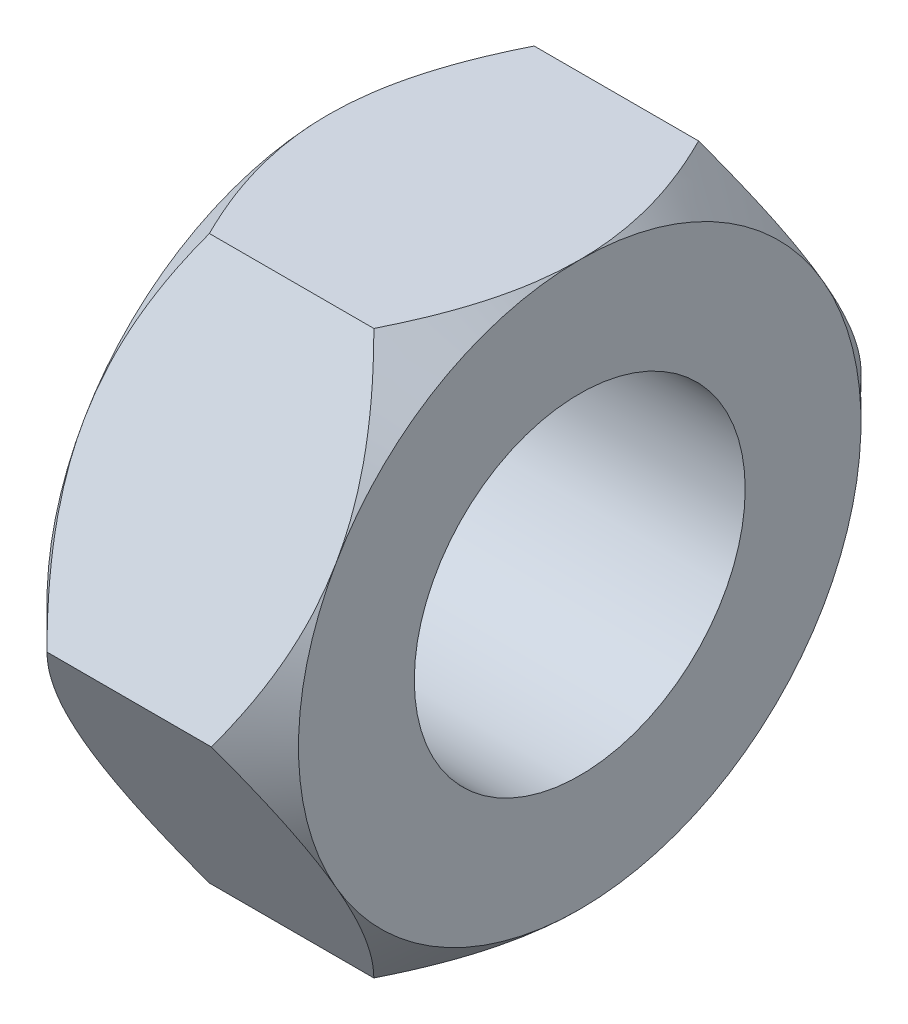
ISO-10303-21;
HEADER;
FILE_DESCRIPTION(('STEP AP214'),'2;1');
FILE_NAME('part.step','',(''),(''),'','','');
FILE_SCHEMA(('AUTOMOTIVE_DESIGN { 1 0 10303 214 1 1 1 1 }'));
ENDSEC;
DATA;
#1=APPLICATION_CONTEXT('core data for automotive mechanical design processes');
#2=APPLICATION_PROTOCOL_DEFINITION('international standard','automotive_design',2000,#1);
#3=PRODUCT_CONTEXT('',#1,'mechanical');
#4=PRODUCT('Part','Part','',(#3));
#5=PRODUCT_RELATED_PRODUCT_CATEGORY('part','',(#4));
#6=PRODUCT_DEFINITION_FORMATION('','',#4);
#7=PRODUCT_DEFINITION_CONTEXT('part definition',#1,'design');
#8=PRODUCT_DEFINITION('design','',#6,#7);
#9=PRODUCT_DEFINITION_SHAPE('','',#8);
#10=(LENGTH_UNIT() NAMED_UNIT(*) SI_UNIT(.MILLI.,.METRE.));
#11=(NAMED_UNIT(*) PLANE_ANGLE_UNIT() SI_UNIT($,.RADIAN.));
#12=(NAMED_UNIT(*) SI_UNIT($,.STERADIAN.) SOLID_ANGLE_UNIT());
#13=UNCERTAINTY_MEASURE_WITH_UNIT(LENGTH_MEASURE(1.E-05),#10,'distance_accuracy_value','');
#14=(GEOMETRIC_REPRESENTATION_CONTEXT(3) GLOBAL_UNCERTAINTY_ASSIGNED_CONTEXT((#13)) GLOBAL_UNIT_ASSIGNED_CONTEXT((#10,
#11,#12)) REPRESENTATION_CONTEXT('',''));
#15=CARTESIAN_POINT('',(0.,0.,0.));
#16=DIRECTION('',(0.,0.,1.));
#17=DIRECTION('',(1.,0.,0.));
#18=AXIS2_PLACEMENT_3D('',#15,#16,#17);
#19=CARTESIAN_POINT('',(0.,0.,0.));
#20=DIRECTION('',(1.,0.,0.));
#21=DIRECTION('',(0.,1.,0.));
#22=AXIS2_PLACEMENT_3D('',#19,#20,#21);
#23=PLANE('',#22);
#24=CARTESIAN_POINT('',(0.,0.,0.));
#25=DIRECTION('',(-1.,0.,0.));
#26=DIRECTION('',(0.,0.,1.));
#27=AXIS2_PLACEMENT_3D('',#24,#25,#26);
#28=CIRCLE('',#27,8.5);
#29=CARTESIAN_POINT('',(0.,4.24999999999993,-7.36121593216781));
#30=VERTEX_POINT('',#29);
#31=CARTESIAN_POINT('',(0.,-4.25,-7.36121593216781));
#32=VERTEX_POINT('',#31);
#33=EDGE_CURVE('E11',#30,#32,#28,.T.);
#34=ORIENTED_EDGE('',*,*,#33,.T.);
#35=CARTESIAN_POINT('',(0.,0.,0.));
#36=DIRECTION('',(-1.,0.,0.));
#37=DIRECTION('',(0.,0.,1.));
#38=AXIS2_PLACEMENT_3D('',#35,#36,#37);
#39=CIRCLE('',#38,8.5);
#40=CARTESIAN_POINT('',(0.,-8.5,0.));
#41=VERTEX_POINT('',#40);
#42=EDGE_CURVE('E25',#32,#41,#39,.T.);
#43=ORIENTED_EDGE('',*,*,#42,.T.);
#44=CARTESIAN_POINT('',(0.,0.,0.));
#45=DIRECTION('',(-1.,0.,0.));
#46=DIRECTION('',(0.,1.,0.));
#47=AXIS2_PLACEMENT_3D('',#44,#45,#46);
#48=CIRCLE('',#47,8.5);
#49=CARTESIAN_POINT('',(0.,-4.25,7.36121593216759));
#50=VERTEX_POINT('',#49);
#51=EDGE_CURVE('E360',#41,#50,#48,.T.);
#52=ORIENTED_EDGE('',*,*,#51,.T.);
#53=CARTESIAN_POINT('',(0.,0.,0.));
#54=DIRECTION('',(-1.,0.,0.));
#55=DIRECTION('',(0.,1.,0.));
#56=AXIS2_PLACEMENT_3D('',#53,#54,#55);
#57=CIRCLE('',#56,8.5);
#58=CARTESIAN_POINT('',(0.,4.24999999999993,7.36121593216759));
#59=VERTEX_POINT('',#58);
#60=EDGE_CURVE('E134',#50,#59,#57,.T.);
#61=ORIENTED_EDGE('',*,*,#60,.T.);
#62=CARTESIAN_POINT('',(0.,0.,0.));
#63=DIRECTION('',(-1.,0.,0.));
#64=DIRECTION('',(0.,1.,0.));
#65=AXIS2_PLACEMENT_3D('',#62,#63,#64);
#66=CIRCLE('',#65,8.5);
#67=CARTESIAN_POINT('',(0.,8.5,0.));
#68=VERTEX_POINT('',#67);
#69=EDGE_CURVE('E393',#59,#68,#66,.T.);
#70=ORIENTED_EDGE('',*,*,#69,.T.);
#71=CARTESIAN_POINT('',(0.,0.,0.));
#72=DIRECTION('',(-1.,0.,0.));
#73=DIRECTION('',(0.,0.,1.));
#74=AXIS2_PLACEMENT_3D('',#71,#72,#73);
#75=CIRCLE('',#74,8.5);
#76=EDGE_CURVE('E32',#68,#30,#75,.T.);
#77=ORIENTED_EDGE('',*,*,#76,.T.);
#78=EDGE_LOOP('',(#34,#43,#52,#61,#70,#77));
#79=FACE_BOUND('',#78,.T.);
#80=CARTESIAN_POINT('',(0.,0.,0.));
#81=DIRECTION('',(1.,0.,0.));
#82=DIRECTION('',(0.,1.,0.));
#83=AXIS2_PLACEMENT_3D('',#80,#81,#82);
#84=CIRCLE('',#83,5.);
#85=CARTESIAN_POINT('',(0.,4.99999999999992,0.));
#86=VERTEX_POINT('',#85);
#87=EDGE_CURVE('E20',#86,#86,#84,.F.);
#88=ORIENTED_EDGE('',*,*,#87,.F.);
#89=EDGE_LOOP('',(#88));
#90=FACE_BOUND('',#89,.T.);
#91=ADVANCED_FACE('F17',(#79,#90),#23,.F.);
#92=CARTESIAN_POINT('',(6.2771556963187,0.,0.));
#93=DIRECTION('',(-1.,0.,0.));
#94=DIRECTION('',(0.,0.,1.));
#95=AXIS2_PLACEMENT_3D('',#92,#93,#94);
#96=CONICAL_SURFACE('',#95,9.82284430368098,0.78539816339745);
#97=CARTESIAN_POINT('',(7.6,-4.25,-7.36121593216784));
#98=CARTESIAN_POINT('',(7.60001515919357,-4.13694792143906,-7.42648658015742));
#99=CARTESIAN_POINT('',(7.59699316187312,-4.02390032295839,-7.49175464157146));
#100=CARTESIAN_POINT('',(7.58498745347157,-3.79805996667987,-7.62214363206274));
#101=CARTESIAN_POINT('',(7.57600468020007,-3.68526717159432,-7.68726458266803));
#102=CARTESIAN_POINT('',(7.55221084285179,-3.4603440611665,-7.81712400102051));
#103=CARTESIAN_POINT('',(7.53741003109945,-3.34821293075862,-7.88186293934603));
#104=CARTESIAN_POINT('',(7.50219326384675,-3.1246187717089,-8.01095508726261));
#105=CARTESIAN_POINT('',(7.48177715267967,-3.01315576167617,-8.0753082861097));
#106=CARTESIAN_POINT('',(7.41318934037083,-2.68340027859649,-8.2656927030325));
#107=CARTESIAN_POINT('',(7.35729647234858,-2.46628706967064,-8.39104307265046));
#108=CARTESIAN_POINT('',(7.22718259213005,-2.03622203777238,-8.63934123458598));
#109=CARTESIAN_POINT('',(7.1529558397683,-1.82327154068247,-8.76228826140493));
#110=CARTESIAN_POINT('',(7.01731534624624,-1.47499253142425,-8.96336724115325));
#111=CARTESIAN_POINT('',(6.96037400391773,-1.33833581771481,-9.04226603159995));
#112=CARTESIAN_POINT('',(6.84054553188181,-1.06702543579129,-9.19890715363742));
#113=CARTESIAN_POINT('',(6.77765965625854,-0.932371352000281,-9.27664972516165));
#114=CARTESIAN_POINT('',(6.64593076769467,-0.663632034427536,-9.43180644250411));
#115=CARTESIAN_POINT('',(6.57703288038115,-0.529567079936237,-9.50920888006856));
#116=CARTESIAN_POINT('',(6.43446542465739,-0.263361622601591,-9.66290267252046));
#117=CARTESIAN_POINT('',(6.36079617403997,-0.131220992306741,-9.73919410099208));
#118=CARTESIAN_POINT('',(6.2850454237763,0.,-9.81495457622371));
#119=B_SPLINE_CURVE_WITH_KNOTS('',3,(#97,#98,#99,#100,#101,#102,#103,#104,#105,#106,#107,#108,
#109,#110,#111,#112,#113,#114,#115,#116,#117,#118),.UNSPECIFIED.,.F.,.F.,(4,2,2,2,2,2,2,2,2,2,
4),(0.,0.391580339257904,0.783099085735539,1.17393098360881,1.56477371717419,2.3344775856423,
3.10442274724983,3.60757640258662,4.11062414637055,4.61887351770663,5.12708907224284),.UNSPECIFIED.);
#120=CARTESIAN_POINT('',(7.6,-4.25,-7.36121593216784));
#121=VERTEX_POINT('',#120);
#122=CARTESIAN_POINT('',(6.2850454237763,0.,-9.81495457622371));
#123=VERTEX_POINT('',#122);
#124=EDGE_CURVE('E245',#121,#123,#119,.T.);
#125=ORIENTED_EDGE('',*,*,#124,.T.);
#126=CARTESIAN_POINT('',(6.2850454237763,0.,-9.81495457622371));
#127=CARTESIAN_POINT('',(6.3699516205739,0.147093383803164,-9.73003017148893));
#128=CARTESIAN_POINT('',(6.45223328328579,0.295306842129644,-9.6444590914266));
#129=CARTESIAN_POINT('',(6.61075078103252,0.5942375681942,-9.47187135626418));
#130=CARTESIAN_POINT('',(6.68698311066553,0.744956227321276,-9.38485389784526));
#131=CARTESIAN_POINT('',(6.90612802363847,1.20280955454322,-9.12051215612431));
#132=CARTESIAN_POINT('',(7.03846244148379,1.51390387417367,-8.9409017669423));
#133=CARTESIAN_POINT('',(7.2077707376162,1.98338150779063,-8.66984872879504));
#134=CARTESIAN_POINT('',(7.25878555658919,2.13801850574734,-8.58056901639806));
#135=CARTESIAN_POINT('',(7.35113981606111,2.44943193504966,-8.40077438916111));
#136=CARTESIAN_POINT('',(7.3924815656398,2.60620784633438,-8.31025977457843));
#137=CARTESIAN_POINT('',(7.46444988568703,2.92116365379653,-8.12841995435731));
#138=CARTESIAN_POINT('',(7.49510489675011,3.07933865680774,-8.0370975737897));
#139=CARTESIAN_POINT('',(7.54505025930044,3.39699973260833,-7.8536958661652));
#140=CARTESIAN_POINT('',(7.56434424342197,3.5564853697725,-7.76161679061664));
#141=CARTESIAN_POINT('',(7.58509137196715,3.80494538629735,-7.61816833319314));
#142=CARTESIAN_POINT('',(7.59066337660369,3.89367407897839,-7.56694079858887));
#143=CARTESIAN_POINT('',(7.5981272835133,4.07159923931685,-7.46421565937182));
#144=CARTESIAN_POINT('',(7.60000452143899,4.16079616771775,-7.41271778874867));
#145=CARTESIAN_POINT('',(7.6,4.24999999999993,-7.36121593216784));
#146=B_SPLINE_CURVE_WITH_KNOTS('',3,(#126,#127,#128,#129,#130,#131,#132,#133,#134,#135,#136,
#137,#138,#139,#140,#141,#142,#143,#144,#145),.UNSPECIFIED.,.F.,.F.,(4,2,2,2,2,2,2,2,2,4),(0.,
0.569593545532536,1.13951477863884,2.28610326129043,2.84300305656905,3.39976977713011,
3.95504325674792,4.51013909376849,4.81789866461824,5.12687727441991),.UNSPECIFIED.);
#147=CARTESIAN_POINT('',(7.6,4.24999999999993,-7.36121593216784));
#148=VERTEX_POINT('',#147);
#149=EDGE_CURVE('E256',#123,#148,#146,.T.);
#150=ORIENTED_EDGE('',*,*,#149,.T.);
#151=CARTESIAN_POINT('',(7.6,0.,-1.34587772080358E-13));
#152=DIRECTION('',(-1.,0.,0.));
#153=DIRECTION('',(0.,0.,1.));
#154=AXIS2_PLACEMENT_3D('',#151,#152,#153);
#155=CIRCLE('',#154,8.5);
#156=EDGE_CURVE('E382',#148,#121,#155,.T.);
#157=ORIENTED_EDGE('',*,*,#156,.T.);
#158=EDGE_LOOP('',(#125,#150,#157));
#159=FACE_BOUND('',#158,.T.);
#160=ADVANCED_FACE('F230',(#159),#96,.T.);
#161=CARTESIAN_POINT('',(6.2771556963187,0.,0.));
#162=DIRECTION('',(-1.,0.,0.));
#163=DIRECTION('',(0.,0.,1.));
#164=AXIS2_PLACEMENT_3D('',#161,#162,#163);
#165=CONICAL_SURFACE('',#164,9.82284430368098,0.78539816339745);
#166=CARTESIAN_POINT('',(7.6,-8.5,-1.34587772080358E-13));
#167=CARTESIAN_POINT('',(7.6000151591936,-8.49999999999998,-0.130541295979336));
#168=CARTESIAN_POINT('',(7.59699316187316,-8.49999999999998,-0.261077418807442));
#169=CARTESIAN_POINT('',(7.58498745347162,-8.49999999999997,-0.521855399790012));
#170=CARTESIAN_POINT('',(7.57600468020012,-8.49999999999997,-0.652097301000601));
#171=CARTESIAN_POINT('',(7.55221084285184,-8.49999999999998,-0.911816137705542));
#172=CARTESIAN_POINT('',(7.53741003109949,-8.49999999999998,-1.0412940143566));
#173=CARTESIAN_POINT('',(7.5021932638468,-8.49999999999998,-1.29947831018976));
#174=CARTESIAN_POINT('',(7.48177715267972,-8.49999999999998,-1.42818470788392));
#175=CARTESIAN_POINT('',(7.41318934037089,-8.49999999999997,-1.80895354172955));
#176=CARTESIAN_POINT('',(7.35729647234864,-8.49999999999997,-2.05965428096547));
#177=CARTESIAN_POINT('',(7.22718259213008,-8.49999999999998,-2.55625060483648));
#178=CARTESIAN_POINT('',(7.15295583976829,-8.50000000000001,-2.80214465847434));
#179=CARTESIAN_POINT('',(7.01731534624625,-8.5,-3.204302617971));
#180=CARTESIAN_POINT('',(6.96037400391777,-8.49999999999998,-3.36210019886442));
#181=CARTESIAN_POINT('',(6.84054553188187,-8.49999999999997,-3.67538244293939));
#182=CARTESIAN_POINT('',(6.77765965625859,-8.49999999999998,-3.83086758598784));
#183=CARTESIAN_POINT('',(6.64593076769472,-8.49999999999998,-4.14118102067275));
#184=CARTESIAN_POINT('',(6.57703288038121,-8.49999999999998,-4.29598589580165));
#185=CARTESIAN_POINT('',(6.43446542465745,-8.49999999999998,-4.60337348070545));
#186=CARTESIAN_POINT('',(6.36079617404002,-8.49999999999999,-4.75595633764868));
#187=CARTESIAN_POINT('',(6.2850454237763,-8.5,-4.90747728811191));
#188=B_SPLINE_CURVE_WITH_KNOTS('',3,(#166,#167,#168,#169,#170,#171,#172,#173,#174,#175,#176,
#177,#178,#179,#180,#181,#182,#183,#184,#185,#186,#187),.UNSPECIFIED.,.F.,.F.,(4,2,2,2,2,2,2,2,
2,2,4),(0.,0.391580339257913,0.783099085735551,1.17393098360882,1.5647737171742,
2.33447758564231,3.10442274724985,3.60757640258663,4.11062414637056,4.61887351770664,
5.12708907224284),.UNSPECIFIED.);
#189=CARTESIAN_POINT('',(7.6,-8.5,-1.34587772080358E-13));
#190=VERTEX_POINT('',#189);
#191=CARTESIAN_POINT('',(6.2850454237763,-8.5,-4.90747728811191));
#192=VERTEX_POINT('',#191);
#193=EDGE_CURVE('E203',#190,#192,#188,.T.);
#194=ORIENTED_EDGE('',*,*,#193,.T.);
#195=CARTESIAN_POINT('',(6.2850454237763,-8.5,-4.90747728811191));
#196=CARTESIAN_POINT('',(6.36995162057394,-8.35290661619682,-4.99240169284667));
#197=CARTESIAN_POINT('',(6.45223328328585,-8.20469315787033,-5.07797277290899));
#198=CARTESIAN_POINT('',(6.6107507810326,-7.90576243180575,-5.25056050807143));
#199=CARTESIAN_POINT('',(6.68698311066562,-7.75504377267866,-5.33757796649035));
#200=CARTESIAN_POINT('',(6.90612802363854,-7.29719044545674,-5.60191970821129));
#201=CARTESIAN_POINT('',(7.03846244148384,-6.98609612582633,-5.78153009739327));
#202=CARTESIAN_POINT('',(7.20777073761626,-6.51661849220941,-6.05258313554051));
#203=CARTESIAN_POINT('',(7.25878555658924,-6.3619814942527,-6.14186284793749));
#204=CARTESIAN_POINT('',(7.35113981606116,-6.05056806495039,-6.32165747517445));
#205=CARTESIAN_POINT('',(7.39248156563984,-5.89379215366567,-6.41217208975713));
#206=CARTESIAN_POINT('',(7.4644498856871,-5.57883634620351,-6.59401190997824));
#207=CARTESIAN_POINT('',(7.49510489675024,-5.42066134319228,-6.68533429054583));
#208=CARTESIAN_POINT('',(7.54505025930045,-5.10300026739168,-6.8687359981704));
#209=CARTESIAN_POINT('',(7.56434424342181,-4.94351463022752,-6.96081507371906));
#210=CARTESIAN_POINT('',(7.58509137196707,-4.69505461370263,-7.10426353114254));
#211=CARTESIAN_POINT('',(7.59066337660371,-4.60632592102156,-7.15549106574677));
#212=CARTESIAN_POINT('',(7.59812728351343,-4.42840076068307,-7.25821620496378));
#213=CARTESIAN_POINT('',(7.60000452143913,-4.33920383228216,-7.30971407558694));
#214=CARTESIAN_POINT('',(7.6,-4.25,-7.36121593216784));
#215=B_SPLINE_CURVE_WITH_KNOTS('',3,(#195,#196,#197,#198,#199,#200,#201,#202,#203,#204,#205,
#206,#207,#208,#209,#210,#211,#212,#213,#214),.UNSPECIFIED.,.F.,.F.,(4,2,2,2,2,2,2,2,2,4),(0.,
0.569593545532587,1.13951477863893,2.28610326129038,2.84300305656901,3.39976977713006,
3.9550432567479,4.51013909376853,4.81789866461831,5.12687727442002),.UNSPECIFIED.);
#216=EDGE_CURVE('E238',#192,#121,#215,.T.);
#217=ORIENTED_EDGE('',*,*,#216,.T.);
#218=CARTESIAN_POINT('',(7.6,0.,-1.34587772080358E-13));
#219=DIRECTION('',(-1.,0.,0.));
#220=DIRECTION('',(0.,0.,1.));
#221=AXIS2_PLACEMENT_3D('',#218,#219,#220);
#222=CIRCLE('',#221,8.5);
#223=EDGE_CURVE('E401',#121,#190,#222,.T.);
#224=ORIENTED_EDGE('',*,*,#223,.T.);
#225=EDGE_LOOP('',(#194,#217,#224));
#226=FACE_BOUND('',#225,.T.);
#227=ADVANCED_FACE('F225',(#226),#165,.T.);
#228=CARTESIAN_POINT('',(6.2771556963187,0.,0.));
#229=DIRECTION('',(-1.,0.,0.));
#230=DIRECTION('',(0.,1.,0.));
#231=AXIS2_PLACEMENT_3D('',#228,#229,#230);
#232=CONICAL_SURFACE('',#231,9.82284430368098,0.78539816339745);
#233=CARTESIAN_POINT('',(7.6,-4.25,7.36121593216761));
#234=CARTESIAN_POINT('',(7.60001515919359,-4.36305207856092,7.29594528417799));
#235=CARTESIAN_POINT('',(7.59699316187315,-4.47609967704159,7.23067722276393));
#236=CARTESIAN_POINT('',(7.58498745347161,-4.70194003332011,7.10028823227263));
#237=CARTESIAN_POINT('',(7.5760046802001,-4.81473282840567,7.03516728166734));
#238=CARTESIAN_POINT('',(7.55221084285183,-5.0396559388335,6.90530786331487));
#239=CARTESIAN_POINT('',(7.53741003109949,-5.15178706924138,6.84056892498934));
#240=CARTESIAN_POINT('',(7.50219326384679,-5.37538122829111,6.71147677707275));
#241=CARTESIAN_POINT('',(7.48177715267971,-5.48684423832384,6.64712357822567));
#242=CARTESIAN_POINT('',(7.41318934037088,-5.81659972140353,6.45673916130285));
#243=CARTESIAN_POINT('',(7.35729647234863,-6.03371293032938,6.33138879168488));
#244=CARTESIAN_POINT('',(7.22718259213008,-6.46377796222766,6.08309062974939));
#245=CARTESIAN_POINT('',(7.15295583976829,-6.6767284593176,5.96014360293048));
#246=CARTESIAN_POINT('',(7.01731534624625,-7.02500746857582,5.75906462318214));
#247=CARTESIAN_POINT('',(6.96037400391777,-7.16166418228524,5.68016583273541));
#248=CARTESIAN_POINT('',(6.84054553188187,-7.43297456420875,5.52352471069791));
#249=CARTESIAN_POINT('',(6.77765965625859,-7.56762864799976,5.4457821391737));
#250=CARTESIAN_POINT('',(6.64593076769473,-7.8363679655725,5.29062542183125));
#251=CARTESIAN_POINT('',(6.57703288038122,-7.97043292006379,5.2132229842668));
#252=CARTESIAN_POINT('',(6.43446542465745,-8.23663837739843,5.0595291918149));
#253=CARTESIAN_POINT('',(6.36079617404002,-8.36877900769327,4.98323776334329));
#254=CARTESIAN_POINT('',(6.2850454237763,-8.5,4.9074772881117));
#255=B_SPLINE_CURVE_WITH_KNOTS('',3,(#233,#234,#235,#236,#237,#238,#239,#240,#241,#242,#243,
#244,#245,#246,#247,#248,#249,#250,#251,#252,#253,#254),.UNSPECIFIED.,.F.,.F.,(4,2,2,2,2,2,2,2,
2,2,4),(0.,0.391580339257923,0.783099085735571,1.17393098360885,1.56477371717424,
2.33447758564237,3.10442274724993,3.6075764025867,4.11062414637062,4.61887351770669,
5.12708907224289),.UNSPECIFIED.);
#256=CARTESIAN_POINT('',(7.6,-4.25,7.36121593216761));
#257=VERTEX_POINT('',#256);
#258=CARTESIAN_POINT('',(6.2850454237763,-8.5,4.9074772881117));
#259=VERTEX_POINT('',#258);
#260=EDGE_CURVE('E366',#257,#259,#255,.T.);
#261=ORIENTED_EDGE('',*,*,#260,.T.);
#262=CARTESIAN_POINT('',(6.2850454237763,-8.5,4.9074772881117));
#263=CARTESIAN_POINT('',(6.36995162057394,-8.49999999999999,4.73762847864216));
#264=CARTESIAN_POINT('',(6.45223328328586,-8.49999999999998,4.56648631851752));
#265=CARTESIAN_POINT('',(6.61075078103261,-8.49999999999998,4.22131084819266));
#266=CARTESIAN_POINT('',(6.68698311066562,-8.49999999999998,4.04727593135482));
#267=CARTESIAN_POINT('',(6.90612802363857,-8.49999999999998,3.51859244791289));
#268=CARTESIAN_POINT('',(7.03846244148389,-8.49999999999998,3.15937166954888));
#269=CARTESIAN_POINT('',(7.20777073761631,-8.49999999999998,2.61726559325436));
#270=CARTESIAN_POINT('',(7.2587855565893,-8.49999999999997,2.4387061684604));
#271=CARTESIAN_POINT('',(7.35113981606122,-8.49999999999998,2.07911691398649));
#272=CARTESIAN_POINT('',(7.39248156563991,-8.49999999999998,1.89808768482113));
#273=CARTESIAN_POINT('',(7.46444988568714,-8.49999999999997,1.53440804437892));
#274=CARTESIAN_POINT('',(7.49510489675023,-8.49999999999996,1.35176328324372));
#275=CARTESIAN_POINT('',(7.54505025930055,-8.49999999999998,0.984959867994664));
#276=CARTESIAN_POINT('',(7.56434424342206,-8.50000000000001,0.800801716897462));
#277=CARTESIAN_POINT('',(7.58509137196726,-8.49999999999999,0.513904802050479));
#278=CARTESIAN_POINT('',(7.59066337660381,-8.49999999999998,0.41144973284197));
#279=CARTESIAN_POINT('',(7.59812728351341,-8.49999999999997,0.205999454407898));
#280=CARTESIAN_POINT('',(7.60000452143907,-8.49999999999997,0.103003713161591));
#281=CARTESIAN_POINT('',(7.6,-8.5,-1.34587772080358E-13));
#282=B_SPLINE_CURVE_WITH_KNOTS('',3,(#262,#263,#264,#265,#266,#267,#268,#269,#270,#271,#272,
#273,#274,#275,#276,#277,#278,#279,#280,#281),.UNSPECIFIED.,.F.,.F.,(4,2,2,2,2,2,2,2,2,4),(0.,
0.569593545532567,1.1395147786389,2.2861032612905,2.84300305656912,3.39976977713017,
3.95504325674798,4.51013909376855,4.81789866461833,5.12687727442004),.UNSPECIFIED.);
#283=EDGE_CURVE('E211',#259,#190,#282,.T.);
#284=ORIENTED_EDGE('',*,*,#283,.T.);
#285=CARTESIAN_POINT('',(7.6,0.,-1.34587772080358E-13));
#286=DIRECTION('',(-1.,0.,0.));
#287=DIRECTION('',(0.,1.,0.));
#288=AXIS2_PLACEMENT_3D('',#285,#286,#287);
#289=CIRCLE('',#288,8.5);
#290=EDGE_CURVE('E402',#190,#257,#289,.T.);
#291=ORIENTED_EDGE('',*,*,#290,.T.);
#292=EDGE_LOOP('',(#261,#284,#291));
#293=FACE_BOUND('',#292,.T.);
#294=ADVANCED_FACE('F229',(#293),#232,.T.);
#295=CARTESIAN_POINT('',(6.2771556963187,0.,0.));
#296=DIRECTION('',(-1.,0.,0.));
#297=DIRECTION('',(0.,1.,0.));
#298=AXIS2_PLACEMENT_3D('',#295,#296,#297);
#299=CONICAL_SURFACE('',#298,9.82284430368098,0.78539816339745);
#300=CARTESIAN_POINT('',(7.6,0.,-1.34587772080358E-13));
#301=DIRECTION('',(-1.,0.,0.));
#302=DIRECTION('',(0.,1.,0.));
#303=AXIS2_PLACEMENT_3D('',#300,#301,#302);
#304=CIRCLE('',#303,8.5);
#305=CARTESIAN_POINT('',(7.6,4.24999999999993,7.36121593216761));
#306=VERTEX_POINT('',#305);
#307=EDGE_CURVE('E406',#257,#306,#304,.T.);
#308=ORIENTED_EDGE('',*,*,#307,.T.);
#309=CARTESIAN_POINT('',(7.6,4.24999999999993,7.36121593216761));
#310=CARTESIAN_POINT('',(7.60001515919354,4.13694792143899,7.42648658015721));
#311=CARTESIAN_POINT('',(7.59699316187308,4.02390032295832,7.49175464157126));
#312=CARTESIAN_POINT('',(7.58498745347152,3.79805996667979,7.62214363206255));
#313=CARTESIAN_POINT('',(7.57600468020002,3.68526717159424,7.68726458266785));
#314=CARTESIAN_POINT('',(7.55221084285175,3.46034406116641,7.81712400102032));
#315=CARTESIAN_POINT('',(7.53741003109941,3.34821293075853,7.88186293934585));
#316=CARTESIAN_POINT('',(7.50219326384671,3.12461877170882,8.01095508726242));
#317=CARTESIAN_POINT('',(7.48177715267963,3.0131557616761,8.07530828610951));
#318=CARTESIAN_POINT('',(7.41318934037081,2.68340027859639,8.26569270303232));
#319=CARTESIAN_POINT('',(7.35729647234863,2.4662870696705,8.39104307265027));
#320=CARTESIAN_POINT('',(7.22718259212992,2.03622203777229,8.63934123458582));
#321=CARTESIAN_POINT('',(7.15295583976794,1.82327154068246,8.76228826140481));
#322=CARTESIAN_POINT('',(7.01731534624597,1.47499253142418,8.96336724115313));
#323=CARTESIAN_POINT('',(6.96037400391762,1.33833581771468,9.04226603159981));
#324=CARTESIAN_POINT('',(6.84054553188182,1.06702543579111,9.19890715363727));
#325=CARTESIAN_POINT('',(6.77765965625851,0.932371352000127,9.27664972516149));
#326=CARTESIAN_POINT('',(6.64593076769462,0.663632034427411,9.43180644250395));
#327=CARTESIAN_POINT('',(6.57703288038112,0.529567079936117,9.50920888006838));
#328=CARTESIAN_POINT('',(6.43446542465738,0.263361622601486,9.66290267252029));
#329=CARTESIAN_POINT('',(6.36079617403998,0.131220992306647,9.73919410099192));
#330=CARTESIAN_POINT('',(6.2850454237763,0.,9.81495457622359));
#331=B_SPLINE_CURVE_WITH_KNOTS('',3,(#309,#310,#311,#312,#313,#314,#315,#316,#317,#318,#319,
#320,#321,#322,#323,#324,#325,#326,#327,#328,#329,#330),.UNSPECIFIED.,.F.,.F.,(4,2,2,2,2,2,2,2,
2,2,4),(0.,0.39158033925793,0.78309908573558,1.17393098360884,1.56477371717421,2.33447758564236,
3.10442274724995,3.60757640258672,4.11062414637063,4.61887351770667,5.12708907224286),.UNSPECIFIED.);
#332=CARTESIAN_POINT('',(6.2850454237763,0.,9.81495457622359));
#333=VERTEX_POINT('',#332);
#334=EDGE_CURVE('E130',#306,#333,#331,.T.);
#335=ORIENTED_EDGE('',*,*,#334,.T.);
#336=CARTESIAN_POINT('',(6.2850454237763,0.,9.81495457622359));
#337=CARTESIAN_POINT('',(6.36995162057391,-0.147093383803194,9.73003017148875));
#338=CARTESIAN_POINT('',(6.45223328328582,-0.295306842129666,9.6444590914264));
#339=CARTESIAN_POINT('',(6.61075078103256,-0.594237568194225,9.47187135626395));
#340=CARTESIAN_POINT('',(6.68698311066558,-0.744956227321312,9.38485389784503));
#341=CARTESIAN_POINT('',(6.90612802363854,-1.20280955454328,9.12051215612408));
#342=CARTESIAN_POINT('',(7.03846244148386,-1.51390387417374,8.94090176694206));
#343=CARTESIAN_POINT('',(7.20777073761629,-1.98338150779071,8.66984872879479));
#344=CARTESIAN_POINT('',(7.25878555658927,-2.13801850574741,8.58056901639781));
#345=CARTESIAN_POINT('',(7.3511398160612,-2.44943193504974,8.40077438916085));
#346=CARTESIAN_POINT('',(7.39248156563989,-2.60620784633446,8.31025977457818));
#347=CARTESIAN_POINT('',(7.46444988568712,-2.9211636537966,8.12841995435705));
#348=CARTESIAN_POINT('',(7.49510489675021,-3.07933865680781,8.03709757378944));
#349=CARTESIAN_POINT('',(7.54505025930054,-3.39699973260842,7.85369586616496));
#350=CARTESIAN_POINT('',(7.56434424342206,-3.55648536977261,7.76161679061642));
#351=CARTESIAN_POINT('',(7.58509137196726,-3.80494538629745,7.6181683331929));
#352=CARTESIAN_POINT('',(7.5906633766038,-3.89367407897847,7.56694079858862));
#353=CARTESIAN_POINT('',(7.59812728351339,-4.07159923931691,7.46421565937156));
#354=CARTESIAN_POINT('',(7.60000452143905,-4.16079616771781,7.41271778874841));
#355=CARTESIAN_POINT('',(7.6,-4.25,7.36121593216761));
#356=B_SPLINE_CURVE_WITH_KNOTS('',3,(#336,#337,#338,#339,#340,#341,#342,#343,#344,#345,#346,
#347,#348,#349,#350,#351,#352,#353,#354,#355),.UNSPECIFIED.,.F.,.F.,(4,2,2,2,2,2,2,2,2,4),(0.,
0.569593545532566,1.13951477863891,2.28610326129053,2.84300305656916,3.39976977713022,
3.95504325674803,4.51013909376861,4.81789866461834,5.12687727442),.UNSPECIFIED.);
#357=EDGE_CURVE('E129',#333,#257,#356,.T.);
#358=ORIENTED_EDGE('',*,*,#357,.T.);
#359=EDGE_LOOP('',(#308,#335,#358));
#360=FACE_BOUND('',#359,.T.);
#361=ADVANCED_FACE('F268',(#360),#299,.T.);
#362=CARTESIAN_POINT('',(6.2771556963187,0.,0.));
#363=DIRECTION('',(-1.,0.,0.));
#364=DIRECTION('',(0.,0.,1.));
#365=AXIS2_PLACEMENT_3D('',#362,#363,#364);
#366=CONICAL_SURFACE('',#365,9.82284430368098,0.78539816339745);
#367=CARTESIAN_POINT('',(7.6,4.24999999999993,-7.36121593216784));
#368=CARTESIAN_POINT('',(7.60001515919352,4.36305207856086,-7.29594528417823));
#369=CARTESIAN_POINT('',(7.59699316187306,4.47609967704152,-7.23067722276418));
#370=CARTESIAN_POINT('',(7.58498745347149,4.70194003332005,-7.10028823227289));
#371=CARTESIAN_POINT('',(7.57600468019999,4.8147328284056,-7.03516728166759));
#372=CARTESIAN_POINT('',(7.55221084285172,5.03965593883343,-6.90530786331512));
#373=CARTESIAN_POINT('',(7.53741003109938,5.15178706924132,-6.84056892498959));
#374=CARTESIAN_POINT('',(7.50219326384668,5.37538122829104,-6.711476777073));
#375=CARTESIAN_POINT('',(7.4817771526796,5.48684423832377,-6.64712357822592));
#376=CARTESIAN_POINT('',(7.41318934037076,5.81659972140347,-6.4567391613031));
#377=CARTESIAN_POINT('',(7.35729647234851,6.03371293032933,-6.33138879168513));
#378=CARTESIAN_POINT('',(7.22718259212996,6.4637779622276,-6.08309062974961));
#379=CARTESIAN_POINT('',(7.15295583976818,6.67672845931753,-5.96014360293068));
#380=CARTESIAN_POINT('',(7.01731534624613,7.02500746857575,-5.75906462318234));
#381=CARTESIAN_POINT('',(6.96037400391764,7.16166418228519,-5.68016583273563));
#382=CARTESIAN_POINT('',(6.84054553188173,7.43297456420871,-5.52352471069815));
#383=CARTESIAN_POINT('',(6.77765965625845,7.56762864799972,-5.44578213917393));
#384=CARTESIAN_POINT('',(6.64593076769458,7.83636796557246,-5.29062542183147));
#385=CARTESIAN_POINT('',(6.57703288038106,7.97043292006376,-5.21322298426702));
#386=CARTESIAN_POINT('',(6.4344654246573,8.2366383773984,-5.05952919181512));
#387=CARTESIAN_POINT('',(6.36079617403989,8.36877900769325,-4.98323776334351));
#388=CARTESIAN_POINT('',(6.2850454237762,8.5,-4.90747728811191));
#389=B_SPLINE_CURVE_WITH_KNOTS('',3,(#367,#368,#369,#370,#371,#372,#373,#374,#375,#376,#377,
#378,#379,#380,#381,#382,#383,#384,#385,#386,#387,#388),.UNSPECIFIED.,.F.,.F.,(4,2,2,2,2,2,2,2,
2,2,4),(0.,0.391580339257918,0.783099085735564,1.17393098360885,1.56477371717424,
2.33447758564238,3.10442274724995,3.60757640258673,4.11062414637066,4.61887351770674,
5.12708907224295),.UNSPECIFIED.);
#390=CARTESIAN_POINT('',(6.2850454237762,8.5,-4.90747728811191));
#391=VERTEX_POINT('',#390);
#392=EDGE_CURVE('E250',#148,#391,#389,.T.);
#393=ORIENTED_EDGE('',*,*,#392,.T.);
#394=CARTESIAN_POINT('',(6.2850454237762,8.5,-4.90747728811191));
#395=CARTESIAN_POINT('',(6.36995162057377,8.50000000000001,-4.73762847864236));
#396=CARTESIAN_POINT('',(6.45223328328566,8.50000000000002,-4.56648631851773));
#397=CARTESIAN_POINT('',(6.61075078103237,8.50000000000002,-4.22131084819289));
#398=CARTESIAN_POINT('',(6.68698311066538,8.50000000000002,-4.04727593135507));
#399=CARTESIAN_POINT('',(6.90612802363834,8.50000000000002,-3.51859244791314));
#400=CARTESIAN_POINT('',(7.03846244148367,8.50000000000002,-3.15937166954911));
#401=CARTESIAN_POINT('',(7.20777073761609,8.50000000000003,-2.61726559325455));
#402=CARTESIAN_POINT('',(7.25878555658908,8.50000000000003,-2.43870616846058));
#403=CARTESIAN_POINT('',(7.35113981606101,8.50000000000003,-2.07911691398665));
#404=CARTESIAN_POINT('',(7.39248156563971,8.50000000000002,-1.89808768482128));
#405=CARTESIAN_POINT('',(7.46444988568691,8.50000000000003,-1.53440804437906));
#406=CARTESIAN_POINT('',(7.49510489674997,8.50000000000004,-1.35176328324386));
#407=CARTESIAN_POINT('',(7.54505025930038,8.50000000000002,-0.984959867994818));
#408=CARTESIAN_POINT('',(7.564344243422,8.49999999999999,-0.800801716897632));
#409=CARTESIAN_POINT('',(7.58509137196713,8.50000000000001,-0.513904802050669));
#410=CARTESIAN_POINT('',(7.59066337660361,8.50000000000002,-0.411449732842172));
#411=CARTESIAN_POINT('',(7.59812728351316,8.50000000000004,-0.205999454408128));
#412=CARTESIAN_POINT('',(7.60000452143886,8.50000000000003,-0.103003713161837));
#413=CARTESIAN_POINT('',(7.6,8.5,-1.34587772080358E-13));
#414=B_SPLINE_CURVE_WITH_KNOTS('',3,(#394,#395,#396,#397,#398,#399,#400,#401,#402,#403,#404,
#405,#406,#407,#408,#409,#410,#411,#412,#413),.UNSPECIFIED.,.F.,.F.,(4,2,2,2,2,2,2,2,2,4),(0.,
0.569593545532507,1.13951477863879,2.28610326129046,2.84300305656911,3.39976977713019,
3.95504325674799,4.51013909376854,4.81789866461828,5.12687727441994),.UNSPECIFIED.);
#415=CARTESIAN_POINT('',(7.6,8.5,-1.34587772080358E-13));
#416=VERTEX_POINT('',#415);
#417=EDGE_CURVE('E272',#391,#416,#414,.T.);
#418=ORIENTED_EDGE('',*,*,#417,.T.);
#419=CARTESIAN_POINT('',(7.6,0.,-1.34587772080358E-13));
#420=DIRECTION('',(-1.,0.,0.));
#421=DIRECTION('',(0.,0.,1.));
#422=AXIS2_PLACEMENT_3D('',#419,#420,#421);
#423=CIRCLE('',#422,8.5);
#424=EDGE_CURVE('E280',#416,#148,#423,.T.);
#425=ORIENTED_EDGE('',*,*,#424,.T.);
#426=EDGE_LOOP('',(#393,#418,#425));
#427=FACE_BOUND('',#426,.T.);
#428=ADVANCED_FACE('F265',(#427),#366,.T.);
#429=CARTESIAN_POINT('',(6.2771556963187,0.,0.));
#430=DIRECTION('',(-1.,0.,0.));
#431=DIRECTION('',(0.,1.,0.));
#432=AXIS2_PLACEMENT_3D('',#429,#430,#431);
#433=CONICAL_SURFACE('',#432,9.82284430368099,0.78539816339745);
#434=CARTESIAN_POINT('',(7.6,8.5,-1.34587772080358E-13));
#435=CARTESIAN_POINT('',(7.60001515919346,8.50000000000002,0.13054129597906));
#436=CARTESIAN_POINT('',(7.59699316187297,8.50000000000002,0.261077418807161));
#437=CARTESIAN_POINT('',(7.58498745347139,8.50000000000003,0.521855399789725));
#438=CARTESIAN_POINT('',(7.5760046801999,8.50000000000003,0.652097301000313));
#439=CARTESIAN_POINT('',(7.55221084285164,8.50000000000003,0.911816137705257));
#440=CARTESIAN_POINT('',(7.53741003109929,8.50000000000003,1.04129401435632));
#441=CARTESIAN_POINT('',(7.5021932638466,8.50000000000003,1.29947831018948));
#442=CARTESIAN_POINT('',(7.48177715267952,8.50000000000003,1.42818470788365));
#443=CARTESIAN_POINT('',(7.41318934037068,8.50000000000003,1.80895354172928));
#444=CARTESIAN_POINT('',(7.35729647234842,8.50000000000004,2.05965428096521));
#445=CARTESIAN_POINT('',(7.22718259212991,8.50000000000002,2.55625060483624));
#446=CARTESIAN_POINT('',(7.15295583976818,8.49999999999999,2.80214465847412));
#447=CARTESIAN_POINT('',(7.01731534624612,8.5,3.20430261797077));
#448=CARTESIAN_POINT('',(6.9603740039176,8.50000000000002,3.36210019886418));
#449=CARTESIAN_POINT('',(6.84054553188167,8.50000000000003,3.67538244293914));
#450=CARTESIAN_POINT('',(6.77765965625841,8.50000000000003,3.83086758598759));
#451=CARTESIAN_POINT('',(6.64593076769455,8.50000000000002,4.14118102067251));
#452=CARTESIAN_POINT('',(6.57703288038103,8.50000000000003,4.2959858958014));
#453=CARTESIAN_POINT('',(6.43446542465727,8.50000000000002,4.60337348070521));
#454=CARTESIAN_POINT('',(6.36079617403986,8.50000000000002,4.75595633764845));
#455=CARTESIAN_POINT('',(6.2850454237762,8.5,4.9074772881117));
#456=B_SPLINE_CURVE_WITH_KNOTS('',3,(#434,#435,#436,#437,#438,#439,#440,#441,#442,#443,#444,
#445,#446,#447,#448,#449,#450,#451,#452,#453,#454,#455),.UNSPECIFIED.,.F.,.F.,(4,2,2,2,2,2,2,2,
2,2,4),(0.,0.391580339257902,0.783099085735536,1.17393098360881,1.5647737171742,
2.33447758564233,3.10442274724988,3.60757640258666,4.11062414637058,4.61887351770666,
5.12708907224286),.UNSPECIFIED.);
#457=CARTESIAN_POINT('',(6.2850454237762,8.5,4.9074772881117));
#458=VERTEX_POINT('',#457);
#459=EDGE_CURVE('E279',#416,#458,#456,.T.);
#460=ORIENTED_EDGE('',*,*,#459,.T.);
#461=CARTESIAN_POINT('',(6.2850454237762,8.5,4.9074772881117));
#462=CARTESIAN_POINT('',(6.36995162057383,8.35290661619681,4.99240169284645));
#463=CARTESIAN_POINT('',(6.45223328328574,8.20469315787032,5.07797277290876));
#464=CARTESIAN_POINT('',(6.61075078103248,7.90576243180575,5.25056050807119));
#465=CARTESIAN_POINT('',(6.6869831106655,7.75504377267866,5.33757796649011));
#466=CARTESIAN_POINT('',(6.90612802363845,7.29719044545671,5.60191970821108));
#467=CARTESIAN_POINT('',(7.03846244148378,6.98609612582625,5.78153009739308));
#468=CARTESIAN_POINT('',(7.20777073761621,6.51661849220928,6.05258313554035));
#469=CARTESIAN_POINT('',(7.25878555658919,6.36198149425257,6.14186284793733));
#470=CARTESIAN_POINT('',(7.35113981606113,6.05056806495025,6.3216574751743));
#471=CARTESIAN_POINT('',(7.39248156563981,5.89379215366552,6.41217208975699));
#472=CARTESIAN_POINT('',(7.46444988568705,5.57883634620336,6.59401190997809));
#473=CARTESIAN_POINT('',(7.49510489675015,5.42066134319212,6.68533429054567));
#474=CARTESIAN_POINT('',(7.54505025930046,5.10300026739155,6.86873599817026));
#475=CARTESIAN_POINT('',(7.56434424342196,4.94351463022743,6.96081507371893));
#476=CARTESIAN_POINT('',(7.58509137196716,4.69505461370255,7.10426353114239));
#477=CARTESIAN_POINT('',(7.59066337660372,4.60632592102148,7.1554910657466));
#478=CARTESIAN_POINT('',(7.59812728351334,4.42840076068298,7.25821620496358));
#479=CARTESIAN_POINT('',(7.60000452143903,4.33920383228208,7.30971407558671));
#480=CARTESIAN_POINT('',(7.6,4.24999999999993,7.36121593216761));
#481=B_SPLINE_CURVE_WITH_KNOTS('',3,(#461,#462,#463,#464,#465,#466,#467,#468,#469,#470,#471,
#472,#473,#474,#475,#476,#477,#478,#479,#480),.UNSPECIFIED.,.F.,.F.,(4,2,2,2,2,2,2,2,2,4),(0.,
0.569593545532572,1.13951477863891,2.28610326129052,2.84300305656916,3.39976977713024,
3.95504325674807,4.51013909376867,4.81789866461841,5.12687727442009),.UNSPECIFIED.);
#482=EDGE_CURVE('E212',#458,#306,#481,.T.);
#483=ORIENTED_EDGE('',*,*,#482,.T.);
#484=CARTESIAN_POINT('',(7.6,0.,-1.34587772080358E-13));
#485=DIRECTION('',(-1.,0.,0.));
#486=DIRECTION('',(0.,1.,0.));
#487=AXIS2_PLACEMENT_3D('',#484,#485,#486);
#488=CIRCLE('',#487,8.5);
#489=EDGE_CURVE('E407',#306,#416,#488,.T.);
#490=ORIENTED_EDGE('',*,*,#489,.T.);
#491=EDGE_LOOP('',(#460,#483,#490));
#492=FACE_BOUND('',#491,.T.);
#493=ADVANCED_FACE('F232',(#492),#433,.T.);
#494=CARTESIAN_POINT('',(0.,-4.25,-7.36121593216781));
#495=DIRECTION('',(0.,0.5,0.866025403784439));
#496=DIRECTION('',(0.,0.866025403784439,-0.5));
#497=AXIS2_PLACEMENT_3D('',#494,#495,#496);
#498=PLANE('',#497);
#499=DIRECTION('',(-1.,0.,0.));
#500=VECTOR('',#499,1.);
#501=CARTESIAN_POINT('',(0.,0.,-9.81495457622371));
#502=LINE('',#501,#500);
#503=CARTESIAN_POINT('',(1.31495457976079,6.12652446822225E-09,-9.8149545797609));
#504=VERTEX_POINT('',#503);
#505=EDGE_CURVE('E371',#123,#504,#502,.T.);
#506=ORIENTED_EDGE('',*,*,#505,.F.);
#507=ORIENTED_EDGE('',*,*,#124,.F.);
#508=ORIENTED_EDGE('',*,*,#216,.F.);
#509=DIRECTION('',(1.,0.,0.));
#510=VECTOR('',#509,1.);
#511=CARTESIAN_POINT('',(0.,-8.5,-4.90747728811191));
#512=LINE('',#511,#510);
#513=CARTESIAN_POINT('',(1.31495457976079,-8.5,-4.9074772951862));
#514=VERTEX_POINT('',#513);
#515=EDGE_CURVE('E210',#192,#514,#512,.F.);
#516=ORIENTED_EDGE('',*,*,#515,.T.);
#517=CARTESIAN_POINT('',(0.,-4.25,-7.36121593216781));
#518=CARTESIAN_POINT('',(-1.51591939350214E-05,-4.36305207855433,-7.29594528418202));
#519=CARTESIAN_POINT('',(0.00300683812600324,-4.4760996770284,-7.23067722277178));
#520=CARTESIAN_POINT('',(0.0150125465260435,-4.70194003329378,-7.10028823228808));
#521=CARTESIAN_POINT('',(0.023995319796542,-4.81473282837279,-7.03516728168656));
#522=CARTESIAN_POINT('',(0.0477891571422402,-5.03965593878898,-6.9053078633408));
#523=CARTESIAN_POINT('',(0.0625899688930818,-5.15178706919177,-6.84056892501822));
#524=CARTESIAN_POINT('',(0.0978067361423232,-5.37538122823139,-6.71147677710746));
#525=CARTESIAN_POINT('',(0.118222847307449,-5.48684423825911,-6.64712357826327));
#526=CARTESIAN_POINT('',(0.186810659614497,-5.81659972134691,-6.45673916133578));
#527=CARTESIAN_POINT('',(0.242703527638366,-6.03371293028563,-6.33138879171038));
#528=CARTESIAN_POINT('',(0.3728174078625,-6.46377796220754,-6.08309062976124));
#529=CARTESIAN_POINT('',(0.447044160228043,-6.67672845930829,-5.96014360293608));
#530=CARTESIAN_POINT('',(0.582684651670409,-7.02500746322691,-5.75906462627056));
#531=CARTESIAN_POINT('',(0.63962599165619,-7.16166417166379,-5.68016583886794));
#532=CARTESIAN_POINT('',(0.759454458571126,-7.43297454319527,-5.52352472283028));
#533=CARTESIAN_POINT('',(0.822340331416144,-7.5676286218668,-5.4457821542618));
#534=CARTESIAN_POINT('',(0.954069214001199,-7.83636792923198,-5.29062544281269));
#535=CARTESIAN_POINT('',(1.02296709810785,-7.97043287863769,-5.2132230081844));
#536=CARTESIAN_POINT('',(1.16553454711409,-8.23663832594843,-5.0595292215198));
#537=CARTESIAN_POINT('',(1.23920379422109,-8.36877895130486,-4.98323779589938));
#538=CARTESIAN_POINT('',(1.3149545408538,-8.49999993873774,-4.90747732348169));
#539=B_SPLINE_CURVE_WITH_KNOTS('',3,(#517,#518,#519,#520,#521,#522,#523,#524,#525,#526,#527,
#528,#529,#530,#531,#532,#533,#534,#535,#536,#537,#538),.UNSPECIFIED.,.F.,.F.,(4,2,2,2,2,2,2,2,
2,2,4),(0.,0.391580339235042,0.783099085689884,1.17393098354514,1.56477371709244,
2.33447758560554,3.10442274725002,3.6075763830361,4.11062410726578,4.61887345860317,
5.12708899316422),.UNSPECIFIED.);
#540=EDGE_CURVE('E348',#32,#514,#539,.T.);
#541=ORIENTED_EDGE('',*,*,#540,.F.);
#542=CARTESIAN_POINT('',(1.31495458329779,1.22530764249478E-08,-9.8149545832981));
#543=CARTESIAN_POINT('',(1.23004838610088,-0.147093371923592,-9.73003017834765));
#544=CARTESIAN_POINT('',(1.14776672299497,-0.295306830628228,-9.64445909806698));
#545=CARTESIAN_POINT('',(0.98924922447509,-0.5942375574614,-9.47187136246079));
#546=CARTESIAN_POINT('',(0.913016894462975,-0.74495621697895,-9.38485390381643));
#547=CARTESIAN_POINT('',(0.693871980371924,-1.20280954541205,-9.12051216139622));
#548=CARTESIAN_POINT('',(0.561537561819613,-1.51390386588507,-8.94090177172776));
#549=CARTESIAN_POINT('',(0.392229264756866,-1.98338150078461,-8.66984873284));
#550=CARTESIAN_POINT('',(0.341214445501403,-2.13801849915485,-8.58056902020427));
#551=CARTESIAN_POINT('',(0.248860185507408,-2.44943192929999,-8.40077439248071));
#552=CARTESIAN_POINT('',(0.207518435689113,-2.606207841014,-8.31025977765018));
#553=CARTESIAN_POINT('',(0.135550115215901,-2.9211636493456,-8.12841995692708));
#554=CARTESIAN_POINT('',(0.104895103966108,-3.0793386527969,-8.03709757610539));
#555=CARTESIAN_POINT('',(0.054949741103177,-3.39699972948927,-7.85369586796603));
#556=CARTESIAN_POINT('',(0.0356557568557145,-3.55648536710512,-7.76161679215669));
#557=CARTESIAN_POINT('',(0.0149086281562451,-3.80494538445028,-7.61816833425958));
#558=CARTESIAN_POINT('',(0.00933662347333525,-3.89367407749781,-7.56694079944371));
#559=CARTESIAN_POINT('',(0.00187271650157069,-4.07159923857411,-7.46421565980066));
#560=CARTESIAN_POINT('',(-4.52143970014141E-06,-4.16079616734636,-7.4127177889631));
#561=CARTESIAN_POINT('',(0.,-4.25,-7.36121593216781));
#562=B_SPLINE_CURVE_WITH_KNOTS('',3,(#542,#543,#544,#545,#546,#547,#548,#549,#550,#551,#552,
#553,#554,#555,#556,#557,#558,#559,#560,#561),.UNSPECIFIED.,.F.,.F.,(4,2,2,2,2,2,2,2,2,4),(0.,
0.569593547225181,1.13951478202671,2.28610326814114,2.84300306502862,3.39976978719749,
3.95504326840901,4.51013910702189,4.81789867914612,5.12687729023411),.UNSPECIFIED.);
#563=EDGE_CURVE('E342',#504,#32,#562,.T.);
#564=ORIENTED_EDGE('',*,*,#563,.F.);
#565=EDGE_LOOP('',(#506,#507,#508,#516,#541,#564));
#566=FACE_BOUND('',#565,.T.);
#567=ADVANCED_FACE('F195',(#566),#498,.F.);
#568=CARTESIAN_POINT('',(0.,4.24999999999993,7.36121593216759));
#569=DIRECTION('',(0.,-0.5,-0.866025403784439));
#570=DIRECTION('',(0.,-0.866025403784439,0.5));
#571=AXIS2_PLACEMENT_3D('',#568,#569,#570);
#572=PLANE('',#571);
#573=DIRECTION('',(-1.,0.,0.));
#574=VECTOR('',#573,1.);
#575=CARTESIAN_POINT('',(0.,0.,9.81495457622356));
#576=LINE('',#575,#574);
#577=CARTESIAN_POINT('',(1.31495455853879,3.06311205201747E-08,9.81495455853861));
#578=VERTEX_POINT('',#577);
#579=EDGE_CURVE('E112',#578,#333,#576,.F.);
#580=ORIENTED_EDGE('',*,*,#579,.T.);
#581=ORIENTED_EDGE('',*,*,#334,.F.);
#582=ORIENTED_EDGE('',*,*,#482,.F.);
#583=DIRECTION('',(-1.,0.,0.));
#584=VECTOR('',#583,1.);
#585=CARTESIAN_POINT('',(0.,8.5,4.90747728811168));
#586=LINE('',#585,#584);
#587=CARTESIAN_POINT('',(1.31495457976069,8.5,4.9074772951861));
#588=VERTEX_POINT('',#587);
#589=EDGE_CURVE('E368',#588,#458,#586,.F.);
#590=ORIENTED_EDGE('',*,*,#589,.F.);
#591=CARTESIAN_POINT('',(0.,4.24999999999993,7.36121593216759));
#592=CARTESIAN_POINT('',(-1.51591939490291E-05,4.36305207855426,7.2959452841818));
#593=CARTESIAN_POINT('',(0.00300683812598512,4.47609967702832,7.23067722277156));
#594=CARTESIAN_POINT('',(0.0150125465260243,4.7019400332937,7.10028823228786));
#595=CARTESIAN_POINT('',(0.0239953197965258,4.81473282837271,7.03516728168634));
#596=CARTESIAN_POINT('',(0.0477891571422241,5.0396559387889,6.90530786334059));
#597=CARTESIAN_POINT('',(0.0625899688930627,5.15178706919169,6.840568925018));
#598=CARTESIAN_POINT('',(0.0978067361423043,5.37538122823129,6.71147677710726));
#599=CARTESIAN_POINT('',(0.118222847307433,5.48684423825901,6.64712357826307));
#600=CARTESIAN_POINT('',(0.18681065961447,5.81659972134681,6.45673916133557));
#601=CARTESIAN_POINT('',(0.242703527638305,6.03371293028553,6.33138879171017));
#602=CARTESIAN_POINT('',(0.372817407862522,6.46377796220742,6.08309062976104));
#603=CARTESIAN_POINT('',(0.447044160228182,6.67672845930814,5.9601436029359));
#604=CARTESIAN_POINT('',(0.582684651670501,7.02500746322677,5.75906462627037));
#605=CARTESIAN_POINT('',(0.6396259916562,7.16166417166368,5.68016583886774));
#606=CARTESIAN_POINT('',(0.759454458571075,7.43297454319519,5.52352472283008));
#607=CARTESIAN_POINT('',(0.822340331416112,7.5676286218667,5.4457821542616));
#608=CARTESIAN_POINT('',(0.954069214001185,7.83636792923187,5.29062544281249));
#609=CARTESIAN_POINT('',(1.02296709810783,7.97043287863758,5.2132230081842));
#610=CARTESIAN_POINT('',(1.16553454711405,8.23663832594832,5.05952922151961));
#611=CARTESIAN_POINT('',(1.23920379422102,8.36877895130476,4.9832377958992));
#612=CARTESIAN_POINT('',(1.31495454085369,8.49999993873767,4.90747732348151));
#613=B_SPLINE_CURVE_WITH_KNOTS('',3,(#591,#592,#593,#594,#595,#596,#597,#598,#599,#600,#601,
#602,#603,#604,#605,#606,#607,#608,#609,#610,#611,#612),.UNSPECIFIED.,.F.,.F.,(4,2,2,2,2,2,2,2,
2,2,4),(0.,0.391580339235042,0.783099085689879,1.17393098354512,1.56477371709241,
2.3344775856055,3.10442274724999,3.60757638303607,4.11062410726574,4.61887345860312,
5.12708899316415),.UNSPECIFIED.);
#614=EDGE_CURVE('E115',#59,#588,#613,.T.);
#615=ORIENTED_EDGE('',*,*,#614,.F.);
#616=CARTESIAN_POINT('',(1.31495454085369,6.1262376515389E-08,9.8149545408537));
#617=CARTESIAN_POINT('',(1.23004834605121,0.147093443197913,9.73003013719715));
#618=CARTESIAN_POINT('',(1.14776668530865,0.295306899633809,9.64445905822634));
#619=CARTESIAN_POINT('',(0.989249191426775,0.594237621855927,9.47187132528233));
#620=CARTESIAN_POINT('',(0.913016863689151,0.744956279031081,9.38485386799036));
#621=CARTESIAN_POINT('',(0.693871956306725,1.2028096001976,9.12051212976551));
#622=CARTESIAN_POINT('',(0.561537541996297,1.51390391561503,8.94090174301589));
#623=CARTESIAN_POINT('',(0.392229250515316,1.98338154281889,8.66984870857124));
#624=CARTESIAN_POINT('',(0.341214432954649,2.13801853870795,8.58056899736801));
#625=CARTESIAN_POINT('',(0.248860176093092,2.44943196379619,8.40077437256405));
#626=CARTESIAN_POINT('',(0.207518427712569,2.60620787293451,8.31025975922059));
#627=CARTESIAN_POINT('',(0.135550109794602,2.92116367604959,8.12841994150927));
#628=CARTESIAN_POINT('',(0.104895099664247,3.0793386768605,8.03709756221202));
#629=CARTESIAN_POINT('',(0.0549497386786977,3.39699974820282,7.85369585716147));
#630=CARTESIAN_POINT('',(0.0356557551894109,3.55648538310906,7.76161678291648));
#631=CARTESIAN_POINT('',(0.0149086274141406,3.80494539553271,7.61816832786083));
#632=CARTESIAN_POINT('',(0.00933662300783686,3.89367408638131,7.56694079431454));
#633=CARTESIAN_POINT('',(0.00187271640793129,4.07159924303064,7.46421565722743));
#634=CARTESIAN_POINT('',(-4.5214393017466E-06,4.16079616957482,7.41271778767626));
#635=CARTESIAN_POINT('',(0.,4.24999999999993,7.36121593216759));
#636=B_SPLINE_CURVE_WITH_KNOTS('',3,(#616,#617,#618,#619,#620,#621,#622,#623,#624,#625,#626,
#627,#628,#629,#630,#631,#632,#633,#634,#635),.UNSPECIFIED.,.F.,.F.,(4,2,2,2,2,2,2,2,2,4),(0.,
0.569593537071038,1.13951476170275,2.28610322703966,2.84300301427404,3.39976972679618,
3.95504319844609,4.51013902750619,4.81789859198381,5.12687719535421),.UNSPECIFIED.);
#637=EDGE_CURVE('E108',#578,#59,#636,.T.);
#638=ORIENTED_EDGE('',*,*,#637,.F.);
#639=EDGE_LOOP('',(#580,#581,#582,#590,#615,#638));
#640=FACE_BOUND('',#639,.T.);
#641=ADVANCED_FACE('F110',(#640),#572,.F.);
#642=CARTESIAN_POINT('',(0.,-8.5,0.));
#643=DIRECTION('',(0.,1.,0.));
#644=DIRECTION('',(1.,0.,0.));
#645=AXIS2_PLACEMENT_3D('',#642,#643,#644);
#646=PLANE('',#645);
#647=ORIENTED_EDGE('',*,*,#515,.F.);
#648=ORIENTED_EDGE('',*,*,#193,.F.);
#649=ORIENTED_EDGE('',*,*,#283,.F.);
#650=DIRECTION('',(-1.,0.,0.));
#651=VECTOR('',#650,1.);
#652=CARTESIAN_POINT('',(0.,-8.5,4.90747728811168));
#653=LINE('',#652,#651);
#654=CARTESIAN_POINT('',(1.31495457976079,-8.50000000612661,4.9074772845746));
#655=VERTEX_POINT('',#654);
#656=EDGE_CURVE('E359',#259,#655,#653,.T.);
#657=ORIENTED_EDGE('',*,*,#656,.T.);
#658=CARTESIAN_POINT('',(0.,-8.5,0.));
#659=CARTESIAN_POINT('',(-1.51591939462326E-05,-8.5,0.130541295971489));
#660=CARTESIAN_POINT('',(0.00300683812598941,-8.5,0.261077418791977));
#661=CARTESIAN_POINT('',(0.0150125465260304,-8.5,0.521855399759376));
#662=CARTESIAN_POINT('',(0.0239953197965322,-8.5,0.652097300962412));
#663=CARTESIAN_POINT('',(0.047789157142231,-8.5,0.911816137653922));
#664=CARTESIAN_POINT('',(0.0625899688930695,-8.5,1.04129401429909));
#665=CARTESIAN_POINT('',(0.0978067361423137,-8.5,1.29947831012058));
#666=CARTESIAN_POINT('',(0.118222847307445,-8.5,1.42818470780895));
#667=CARTESIAN_POINT('',(0.186810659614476,-8.5,1.80895354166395));
#668=CARTESIAN_POINT('',(0.242703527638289,-8.5,2.05965428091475));
#669=CARTESIAN_POINT('',(0.372817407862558,-8.5,2.55625060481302));
#670=CARTESIAN_POINT('',(0.447044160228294,-8.5,2.80214465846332));
#671=CARTESIAN_POINT('',(0.582684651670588,-8.5,3.20430261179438));
#672=CARTESIAN_POINT('',(0.639625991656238,-8.5,3.36210018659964));
#673=CARTESIAN_POINT('',(0.759454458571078,-8.5,3.67538241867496));
#674=CARTESIAN_POINT('',(0.822340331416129,-8.5,3.83086755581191));
#675=CARTESIAN_POINT('',(0.954069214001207,-8.5,4.14118097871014));
#676=CARTESIAN_POINT('',(1.02296709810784,-8.5,4.29598584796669));
#677=CARTESIAN_POINT('',(1.16553454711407,-8.5,4.60337342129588));
#678=CARTESIAN_POINT('',(1.23920379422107,-8.5,4.75595627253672));
#679=CARTESIAN_POINT('',(1.3149545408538,-8.5,4.90747721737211));
#680=B_SPLINE_CURVE_WITH_KNOTS('',3,(#658,#659,#660,#661,#662,#663,#664,#665,#666,#667,#668,
#669,#670,#671,#672,#673,#674,#675,#676,#677,#678,#679),.UNSPECIFIED.,.F.,.F.,(4,2,2,2,2,2,2,2,
2,2,4),(0.,0.39158033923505,0.783099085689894,1.17393098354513,1.56477371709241,
2.33447758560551,3.10442274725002,3.60757638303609,4.11062410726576,4.61887345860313,
5.12708899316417),.UNSPECIFIED.);
#681=EDGE_CURVE('E175',#41,#655,#680,.T.);
#682=ORIENTED_EDGE('',*,*,#681,.F.);
#683=CARTESIAN_POINT('',(1.3149545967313,-8.49999996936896,-4.90747729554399));
#684=CARTESIAN_POINT('',(1.23004839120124,-8.49999998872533,-4.73762849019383));
#685=CARTESIAN_POINT('',(1.14776672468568,-8.4999999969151,-4.56648633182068));
#686=CARTESIAN_POINT('',(0.989249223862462,-8.50000000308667,-4.22131086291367));
#687=CARTESIAN_POINT('',(0.913016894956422,-8.5000000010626,-4.04727594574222));
#688=CARTESIAN_POINT('',(0.693871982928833,-8.49999999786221,-3.51859246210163));
#689=CARTESIAN_POINT('',(0.561537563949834,-8.49999999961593,-3.15937168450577));
#690=CARTESIAN_POINT('',(0.392229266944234,-8.50000000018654,-2.61726560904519));
#691=CARTESIAN_POINT('',(0.341214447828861,-8.50000000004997,-2.4387061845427));
#692=CARTESIAN_POINT('',(0.248860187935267,-8.49999999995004,-2.07911693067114));
#693=CARTESIAN_POINT('',(0.207518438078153,-8.49999999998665,-1.89808770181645));
#694=CARTESIAN_POINT('',(0.135550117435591,-8.50000000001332,-1.53440806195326));
#695=CARTESIAN_POINT('',(0.10489510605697,-8.50000000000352,-1.35176330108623));
#696=CARTESIAN_POINT('',(0.0549497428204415,-8.49999999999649,-0.984959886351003));
#697=CARTESIAN_POINT('',(0.0356557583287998,-8.49999999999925,-0.800801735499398));
#698=CARTESIAN_POINT('',(0.0149086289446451,-8.50000000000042,-0.513904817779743));
#699=CARTESIAN_POINT('',(0.0093366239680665,-8.50000000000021,-0.411449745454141));
#700=CARTESIAN_POINT('',(0.0018727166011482,-8.49999999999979,-0.205999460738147));
#701=CARTESIAN_POINT('',(-4.52144008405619E-06,-8.49999999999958,-0.103003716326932));
#702=CARTESIAN_POINT('',(0.,-8.5,0.));
#703=B_SPLINE_CURVE_WITH_KNOTS('',3,(#683,#684,#685,#686,#687,#688,#689,#690,#691,#692,#693,
#694,#695,#696,#697,#698,#699,#700,#701,#702),.UNSPECIFIED.,.F.,.F.,(4,2,2,2,2,2,2,2,2,4),(0.,
0.569593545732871,1.13951477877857,2.286103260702,2.84300305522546,3.39976977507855,
3.95504325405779,4.51013909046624,4.81789867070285,5.12687728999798),.UNSPECIFIED.);
#704=EDGE_CURVE('E183',#514,#41,#703,.T.);
#705=ORIENTED_EDGE('',*,*,#704,.F.);
#706=EDGE_LOOP('',(#647,#648,#649,#657,#682,#705));
#707=FACE_BOUND('',#706,.T.);
#708=ADVANCED_FACE('F189',(#707),#646,.F.);
#709=CARTESIAN_POINT('',(0.,-4.25,7.36121593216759));
#710=DIRECTION('',(0.,0.5,-0.866025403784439));
#711=DIRECTION('',(0.,-0.866025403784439,-0.5));
#712=AXIS2_PLACEMENT_3D('',#709,#710,#711);
#713=PLANE('',#712);
#714=ORIENTED_EDGE('',*,*,#656,.F.);
#715=ORIENTED_EDGE('',*,*,#260,.F.);
#716=ORIENTED_EDGE('',*,*,#357,.F.);
#717=ORIENTED_EDGE('',*,*,#579,.F.);
#718=CARTESIAN_POINT('',(0.,-4.25,7.36121593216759));
#719=CARTESIAN_POINT('',(-1.51591939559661E-05,-4.13694792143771,7.42648658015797));
#720=CARTESIAN_POINT('',(0.00300683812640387,-4.0239003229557,7.4917546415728));
#721=CARTESIAN_POINT('',(0.0150125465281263,-3.7980599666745,7.62214363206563));
#722=CARTESIAN_POINT('',(0.0239953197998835,-3.68526717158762,7.68726458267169));
#723=CARTESIAN_POINT('',(0.0477891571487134,-3.46034406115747,7.81712400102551));
#724=CARTESIAN_POINT('',(0.0625899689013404,-3.34821293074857,7.88186293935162));
#725=CARTESIAN_POINT('',(0.0978067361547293,-3.12461877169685,8.01095508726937));
#726=CARTESIAN_POINT('',(0.118222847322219,-3.01315576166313,8.07530828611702));
#727=CARTESIAN_POINT('',(0.186810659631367,-2.68340027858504,8.2656927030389));
#728=CARTESIAN_POINT('',(0.242703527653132,-2.4662870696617,8.39104307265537));
#729=CARTESIAN_POINT('',(0.372817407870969,-2.03622203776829,8.63934123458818));
#730=CARTESIAN_POINT('',(0.447044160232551,-1.82327154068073,8.76228826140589));
#731=CARTESIAN_POINT('',(0.582684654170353,-1.4749925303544,8.96336724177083));
#732=CARTESIAN_POINT('',(0.639625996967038,-1.33833581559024,9.04226603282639));
#733=CARTESIAN_POINT('',(0.759454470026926,-1.0670254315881,9.1989071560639));
#734=CARTESIAN_POINT('',(0.82234034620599,-0.93237134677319,9.27664972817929));
#735=CARTESIAN_POINT('',(0.954069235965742,-0.663632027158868,9.43180644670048));
#736=CARTESIAN_POINT('',(1.02296712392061,-0.529567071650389,9.50920888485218));
#737=CARTESIAN_POINT('',(1.16553458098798,-0.263361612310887,9.6629026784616));
#738=CARTESIAN_POINT('',(1.2392038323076,-0.131220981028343,9.73919410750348));
#739=CARTESIAN_POINT('',(1.31495458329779,1.22530764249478E-08,9.8149545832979));
#740=B_SPLINE_CURVE_WITH_KNOTS('',3,(#718,#719,#720,#721,#722,#723,#724,#725,#726,#727,#728,
#729,#730,#731,#732,#733,#734,#735,#736,#737,#738,#739),.UNSPECIFIED.,.F.,.F.,(4,2,2,2,2,2,2,2,
2,2,4),(0.,0.391580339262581,0.783099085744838,1.17393098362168,1.56477371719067,
2.33447758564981,3.10442274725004,3.60757640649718,4.11062415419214,4.61887352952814,
5.12708908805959),.UNSPECIFIED.);
#741=EDGE_CURVE('E118',#50,#578,#740,.T.);
#742=ORIENTED_EDGE('',*,*,#741,.F.);
#743=CARTESIAN_POINT('',(1.3149545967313,-8.49999999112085,4.9074772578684));
#744=CARTESIAN_POINT('',(1.23004839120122,-8.35290662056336,4.99240167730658));
#745=CARTESIAN_POINT('',(1.14776672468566,-8.20469316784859,5.0779727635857));
#746=CARTESIAN_POINT('',(0.98924922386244,-7.9057624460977,5.25056050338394));
#747=CARTESIAN_POINT('',(0.913016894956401,-7.75504378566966,5.33757796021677));
#748=CARTESIAN_POINT('',(0.693871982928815,-7.29719045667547,5.60191969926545));
#749=CARTESIAN_POINT('',(0.561537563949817,-6.98609613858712,5.78153008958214));
#750=CARTESIAN_POINT('',(0.392229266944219,-6.51661850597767,6.05258312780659));
#751=CARTESIAN_POINT('',(0.341214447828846,-6.3619815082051,6.14186283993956));
#752=CARTESIAN_POINT('',(0.248860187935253,-6.05056807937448,6.3216574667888));
#753=CARTESIAN_POINT('',(0.207518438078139,-5.89379216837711,6.41217208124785));
#754=CARTESIAN_POINT('',(0.135550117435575,-5.57883636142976,6.59401190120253));
#755=CARTESIAN_POINT('',(0.104895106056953,-5.42066135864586,6.68533428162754));
#756=CARTESIAN_POINT('',(0.054949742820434,-5.10300028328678,6.86873598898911));
#757=CARTESIAN_POINT('',(0.0356557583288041,-4.94351464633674,6.96081506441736));
#758=CARTESIAN_POINT('',(0.0149086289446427,-4.69505462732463,7.10426352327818));
#759=CARTESIAN_POINT('',(0.0093366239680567,-4.60632593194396,7.15549105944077));
#760=CARTESIAN_POINT('',(0.00187271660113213,-4.42840076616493,7.25821620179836));
#761=CARTESIAN_POINT('',(-4.52144009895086E-06,-4.33920383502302,7.30971407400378));
#762=CARTESIAN_POINT('',(0.,-4.25,7.36121593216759));
#763=B_SPLINE_CURVE_WITH_KNOTS('',3,(#743,#744,#745,#746,#747,#748,#749,#750,#751,#752,#753,
#754,#755,#756,#757,#758,#759,#760,#761,#762),.UNSPECIFIED.,.F.,.F.,(4,2,2,2,2,2,2,2,2,4),(0.,
0.569593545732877,1.13951477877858,2.286103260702,2.84300305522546,3.39976977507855,
3.95504325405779,4.51013909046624,4.81789867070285,5.12687728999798),.UNSPECIFIED.);
#764=EDGE_CURVE('E119',#655,#50,#763,.T.);
#765=ORIENTED_EDGE('',*,*,#764,.F.);
#766=EDGE_LOOP('',(#714,#715,#716,#717,#742,#765));
#767=FACE_BOUND('',#766,.T.);
#768=ADVANCED_FACE('F124',(#767),#713,.F.);
#769=CARTESIAN_POINT('',(1.32284430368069,0.,0.));
#770=DIRECTION('',(1.,0.,0.));
#771=DIRECTION('',(0.,-1.,0.));
#772=AXIS2_PLACEMENT_3D('',#769,#770,#771);
#773=CONICAL_SURFACE('',#772,9.82284430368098,0.78539816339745);
#774=ORIENTED_EDGE('',*,*,#764,.T.);
#775=ORIENTED_EDGE('',*,*,#51,.F.);
#776=ORIENTED_EDGE('',*,*,#681,.T.);
#777=EDGE_LOOP('',(#774,#775,#776));
#778=FACE_BOUND('',#777,.T.);
#779=ADVANCED_FACE('F160',(#778),#773,.T.);
#780=CARTESIAN_POINT('',(1.32284430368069,0.,0.));
#781=DIRECTION('',(1.,0.,0.));
#782=DIRECTION('',(0.,0.,-1.));
#783=AXIS2_PLACEMENT_3D('',#780,#781,#782);
#784=CONICAL_SURFACE('',#783,9.82284430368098,0.78539816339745);
#785=ORIENTED_EDGE('',*,*,#60,.F.);
#786=ORIENTED_EDGE('',*,*,#741,.T.);
#787=ORIENTED_EDGE('',*,*,#637,.T.);
#788=EDGE_LOOP('',(#785,#786,#787));
#789=FACE_BOUND('',#788,.T.);
#790=ADVANCED_FACE('F132',(#789),#784,.T.);
#791=CARTESIAN_POINT('',(1.32284430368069,0.,0.));
#792=DIRECTION('',(1.,0.,0.));
#793=DIRECTION('',(0.,-1.,0.));
#794=AXIS2_PLACEMENT_3D('',#791,#792,#793);
#795=CONICAL_SURFACE('',#794,9.82284430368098,0.78539816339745);
#796=ORIENTED_EDGE('',*,*,#704,.T.);
#797=ORIENTED_EDGE('',*,*,#42,.F.);
#798=ORIENTED_EDGE('',*,*,#540,.T.);
#799=EDGE_LOOP('',(#796,#797,#798));
#800=FACE_BOUND('',#799,.T.);
#801=ADVANCED_FACE('F159',(#800),#795,.T.);
#802=CARTESIAN_POINT('',(0.,8.5,0.));
#803=DIRECTION('',(0.,-1.,0.));
#804=DIRECTION('',(0.,0.,1.));
#805=AXIS2_PLACEMENT_3D('',#802,#803,#804);
#806=PLANE('',#805);
#807=ORIENTED_EDGE('',*,*,#589,.T.);
#808=ORIENTED_EDGE('',*,*,#459,.F.);
#809=ORIENTED_EDGE('',*,*,#417,.F.);
#810=DIRECTION('',(-1.,0.,0.));
#811=VECTOR('',#810,1.);
#812=CARTESIAN_POINT('',(0.,8.5,-4.90747728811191));
#813=LINE('',#812,#811);
#814=CARTESIAN_POINT('',(1.31495457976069,8.50000000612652,-4.9074772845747));
#815=VERTEX_POINT('',#814);
#816=EDGE_CURVE('E145',#391,#815,#813,.T.);
#817=ORIENTED_EDGE('',*,*,#816,.T.);
#818=CARTESIAN_POINT('',(0.,8.5,0.));
#819=CARTESIAN_POINT('',(-1.51591938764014E-05,8.5,-0.13054129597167));
#820=CARTESIAN_POINT('',(0.00300683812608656,8.5,-0.26107741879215));
#821=CARTESIAN_POINT('',(0.0150125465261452,8.5,-0.521855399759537));
#822=CARTESIAN_POINT('',(0.0239953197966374,8.5,-0.652097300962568));
#823=CARTESIAN_POINT('',(0.047789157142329,8.5,-0.911816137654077));
#824=CARTESIAN_POINT('',(0.0625899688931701,8.5,-1.04129401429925));
#825=CARTESIAN_POINT('',(0.0978067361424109,8.5,-1.29947831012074));
#826=CARTESIAN_POINT('',(0.118222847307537,8.5,-1.42818470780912));
#827=CARTESIAN_POINT('',(0.186810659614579,8.5,-1.80895354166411));
#828=CARTESIAN_POINT('',(0.242703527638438,8.5,-2.0596542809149));
#829=CARTESIAN_POINT('',(0.372817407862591,8.5,-2.5562506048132));
#830=CARTESIAN_POINT('',(0.447044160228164,8.5,-2.80214465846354));
#831=CARTESIAN_POINT('',(0.582684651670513,8.5,-3.20430261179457));
#832=CARTESIAN_POINT('',(0.639625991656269,8.5,-3.36210018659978));
#833=CARTESIAN_POINT('',(0.759454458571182,8.5,-3.67538241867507));
#834=CARTESIAN_POINT('',(0.8223403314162,8.5,-3.83086755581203));
#835=CARTESIAN_POINT('',(0.95406921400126,8.5,-4.14118097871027));
#836=CARTESIAN_POINT('',(1.02296709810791,8.5,-4.29598584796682));
#837=CARTESIAN_POINT('',(1.16553454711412,8.5,-4.60337342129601));
#838=CARTESIAN_POINT('',(1.23920379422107,8.5,-4.75595627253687));
#839=CARTESIAN_POINT('',(1.31495454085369,8.5,-4.90747721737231));
#840=B_SPLINE_CURVE_WITH_KNOTS('',3,(#818,#819,#820,#821,#822,#823,#824,#825,#826,#827,#828,
#829,#830,#831,#832,#833,#834,#835,#836,#837,#838,#839),.UNSPECIFIED.,.F.,.F.,(4,2,2,2,2,2,2,2,
2,2,4),(0.,0.391580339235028,0.783099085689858,1.17393098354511,1.56477371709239,
2.33447758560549,3.10442274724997,3.60757638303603,4.1106241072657,4.61887345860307,
5.1270889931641),.UNSPECIFIED.);
#841=EDGE_CURVE('E296',#68,#815,#840,.T.);
#842=ORIENTED_EDGE('',*,*,#841,.F.);
#843=CARTESIAN_POINT('',(1.3149545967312,8.49999996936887,4.9074772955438));
#844=CARTESIAN_POINT('',(1.23004839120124,8.49999998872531,4.73762849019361));
#845=CARTESIAN_POINT('',(1.14776672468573,8.4999999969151,4.56648633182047));
#846=CARTESIAN_POINT('',(0.989249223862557,8.50000000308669,4.22131086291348));
#847=CARTESIAN_POINT('',(0.913016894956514,8.50000000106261,4.04727594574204));
#848=CARTESIAN_POINT('',(0.693871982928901,8.49999999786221,3.51859246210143));
#849=CARTESIAN_POINT('',(0.561537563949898,8.49999999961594,3.15937168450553));
#850=CARTESIAN_POINT('',(0.392229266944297,8.50000000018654,2.61726560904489));
#851=CARTESIAN_POINT('',(0.341214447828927,8.50000000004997,2.4387061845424));
#852=CARTESIAN_POINT('',(0.248860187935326,8.49999999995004,2.07911693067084));
#853=CARTESIAN_POINT('',(0.207518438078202,8.49999999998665,1.89808770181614));
#854=CARTESIAN_POINT('',(0.135550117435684,8.50000000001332,1.53440806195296));
#855=CARTESIAN_POINT('',(0.104895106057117,8.50000000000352,1.35176330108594));
#856=CARTESIAN_POINT('',(0.0549497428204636,8.49999999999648,0.984959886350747));
#857=CARTESIAN_POINT('',(0.0356557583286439,8.49999999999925,0.800801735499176));
#858=CARTESIAN_POINT('',(0.0149086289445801,8.50000000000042,0.513904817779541));
#859=CARTESIAN_POINT('',(0.00933662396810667,8.50000000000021,0.411449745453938));
#860=CARTESIAN_POINT('',(0.00187271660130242,8.49999999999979,0.205999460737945));
#861=CARTESIAN_POINT('',(-4.52143992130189E-06,8.49999999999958,0.103003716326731));
#862=CARTESIAN_POINT('',(0.,8.5,0.));
#863=B_SPLINE_CURVE_WITH_KNOTS('',3,(#843,#844,#845,#846,#847,#848,#849,#850,#851,#852,#853,
#854,#855,#856,#857,#858,#859,#860,#861,#862),.UNSPECIFIED.,.F.,.F.,(4,2,2,2,2,2,2,2,2,4),(0.,
0.569593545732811,1.13951477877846,2.28610326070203,2.8430030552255,3.39976977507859,
3.9550432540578,4.5101390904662,4.8178986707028,5.12687728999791),.UNSPECIFIED.);
#864=EDGE_CURVE('E305',#588,#68,#863,.T.);
#865=ORIENTED_EDGE('',*,*,#864,.F.);
#866=EDGE_LOOP('',(#807,#808,#809,#817,#842,#865));
#867=FACE_BOUND('',#866,.T.);
#868=ADVANCED_FACE('F286',(#867),#806,.F.);
#869=CARTESIAN_POINT('',(1.32284430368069,0.,0.));
#870=DIRECTION('',(1.,0.,0.));
#871=DIRECTION('',(0.,-1.,0.));
#872=AXIS2_PLACEMENT_3D('',#869,#870,#871);
#873=CONICAL_SURFACE('',#872,9.82284430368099,0.78539816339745);
#874=ORIENTED_EDGE('',*,*,#864,.T.);
#875=ORIENTED_EDGE('',*,*,#69,.F.);
#876=ORIENTED_EDGE('',*,*,#614,.T.);
#877=EDGE_LOOP('',(#874,#875,#876));
#878=FACE_BOUND('',#877,.T.);
#879=ADVANCED_FACE('F290',(#878),#873,.T.);
#880=CARTESIAN_POINT('',(0.,4.24999999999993,-7.36121593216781));
#881=DIRECTION('',(0.,-0.5,0.866025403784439));
#882=DIRECTION('',(0.,0.866025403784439,0.5));
#883=AXIS2_PLACEMENT_3D('',#880,#881,#882);
#884=PLANE('',#883);
#885=ORIENTED_EDGE('',*,*,#816,.F.);
#886=ORIENTED_EDGE('',*,*,#392,.F.);
#887=ORIENTED_EDGE('',*,*,#149,.F.);
#888=ORIENTED_EDGE('',*,*,#505,.T.);
#889=CARTESIAN_POINT('',(0.,4.24999999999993,-7.36121593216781));
#890=CARTESIAN_POINT('',(-1.51591939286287E-05,4.1369479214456,-7.4264865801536));
#891=CARTESIAN_POINT('',(0.00300683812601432,4.02390032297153,-7.49175464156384));
#892=CARTESIAN_POINT('',(0.0150125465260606,3.79805996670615,-7.62214363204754));
#893=CARTESIAN_POINT('',(0.0239953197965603,3.68526717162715,-7.68726458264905));
#894=CARTESIAN_POINT('',(0.0477891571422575,3.46034406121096,-7.81712400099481));
#895=CARTESIAN_POINT('',(0.0625899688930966,3.34821293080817,-7.88186293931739));
#896=CARTESIAN_POINT('',(0.0978067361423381,3.12461877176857,-8.01095508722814));
#897=CARTESIAN_POINT('',(0.118222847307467,3.01315576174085,-8.07530828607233));
#898=CARTESIAN_POINT('',(0.186810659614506,2.68340027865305,-8.26569270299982));
#899=CARTESIAN_POINT('',(0.24270352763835,2.46628706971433,-8.39104307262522));
#900=CARTESIAN_POINT('',(0.372817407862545,2.03622203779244,-8.63934123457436));
#901=CARTESIAN_POINT('',(0.447044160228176,1.82327154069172,-8.76228826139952));
#902=CARTESIAN_POINT('',(0.582684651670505,1.47499253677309,-8.96336723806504));
#903=CARTESIAN_POINT('',(0.639625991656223,1.33833582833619,-9.04226602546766));
#904=CARTESIAN_POINT('',(0.759454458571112,1.06702545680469,-9.19890714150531));
#905=CARTESIAN_POINT('',(0.822340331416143,0.932371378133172,-9.27664971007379));
#906=CARTESIAN_POINT('',(0.954069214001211,0.663632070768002,-9.4318064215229));
#907=CARTESIAN_POINT('',(1.02296709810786,0.529567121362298,-9.50920885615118));
#908=CARTESIAN_POINT('',(1.16553454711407,0.263361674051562,-9.66290264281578));
#909=CARTESIAN_POINT('',(1.23920379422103,0.131221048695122,-9.7391940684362));
#910=CARTESIAN_POINT('',(1.31495454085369,6.12622225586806E-08,-9.81495454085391));
#911=B_SPLINE_CURVE_WITH_KNOTS('',3,(#889,#890,#891,#892,#893,#894,#895,#896,#897,#898,#899,
#900,#901,#902,#903,#904,#905,#906,#907,#908,#909,#910),.UNSPECIFIED.,.F.,.F.,(4,2,2,2,2,2,2,2,
2,2,4),(0.,0.391580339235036,0.783099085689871,1.17393098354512,1.5647737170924,
2.33447758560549,3.10442274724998,3.60757638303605,4.11062410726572,4.61887345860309,
5.12708899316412),.UNSPECIFIED.);
#912=EDGE_CURVE('E335',#30,#504,#911,.T.);
#913=ORIENTED_EDGE('',*,*,#912,.F.);
#914=CARTESIAN_POINT('',(1.31495458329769,8.50000001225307,-4.9074772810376));
#915=CARTESIAN_POINT('',(1.23004838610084,8.35290662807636,-4.99240168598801));
#916=CARTESIAN_POINT('',(1.14776672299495,8.2046931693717,-5.07797276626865));
#917=CARTESIAN_POINT('',(0.989249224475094,7.90576244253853,-5.25056050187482));
#918=CARTESIAN_POINT('',(0.913016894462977,7.75504378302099,-5.33757796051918));
#919=CARTESIAN_POINT('',(0.693871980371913,7.29719045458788,-5.6019197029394));
#920=CARTESIAN_POINT('',(0.561537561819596,6.98609613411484,-5.78153009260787));
#921=CARTESIAN_POINT('',(0.392229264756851,6.51661849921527,-6.05258313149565));
#922=CARTESIAN_POINT('',(0.341214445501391,6.36198150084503,-6.14186284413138));
#923=CARTESIAN_POINT('',(0.248860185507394,6.05056807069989,-6.32165747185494));
#924=CARTESIAN_POINT('',(0.207518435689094,5.89379215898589,-6.41217208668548));
#925=CARTESIAN_POINT('',(0.135550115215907,5.57883635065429,-6.59401190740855));
#926=CARTESIAN_POINT('',(0.104895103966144,5.42066134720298,-6.68533428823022));
#927=CARTESIAN_POINT('',(0.0549497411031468,5.10300027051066,-6.86873599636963));
#928=CARTESIAN_POINT('',(0.0356557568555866,4.94351463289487,-6.96081507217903));
#929=CARTESIAN_POINT('',(0.0149086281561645,4.6950546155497,-7.10426353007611));
#930=CARTESIAN_POINT('',(0.00933662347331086,4.60632592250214,-7.15549106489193));
#931=CARTESIAN_POINT('',(0.00187271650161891,4.4284007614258,-7.25821620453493));
#932=CARTESIAN_POINT('',(-4.52143963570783E-06,4.33920383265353,-7.30971407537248));
#933=CARTESIAN_POINT('',(0.,4.24999999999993,-7.36121593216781));
#934=B_SPLINE_CURVE_WITH_KNOTS('',3,(#914,#915,#916,#917,#918,#919,#920,#921,#922,#923,#924,
#925,#926,#927,#928,#929,#930,#931,#932,#933),.UNSPECIFIED.,.F.,.F.,(4,2,2,2,2,2,2,2,2,4),(0.,
0.569593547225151,1.13951478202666,2.28610326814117,2.84300306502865,3.39976978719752,
3.95504326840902,4.51013910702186,4.81789867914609,5.12687729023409),.UNSPECIFIED.);
#935=EDGE_CURVE('E328',#815,#30,#934,.T.);
#936=ORIENTED_EDGE('',*,*,#935,.F.);
#937=EDGE_LOOP('',(#885,#886,#887,#888,#913,#936));
#938=FACE_BOUND('',#937,.T.);
#939=ADVANCED_FACE('F262',(#938),#884,.F.);
#940=CARTESIAN_POINT('',(1.32284430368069,0.,0.));
#941=DIRECTION('',(1.,0.,0.));
#942=DIRECTION('',(0.,0.,-1.));
#943=AXIS2_PLACEMENT_3D('',#940,#941,#942);
#944=CONICAL_SURFACE('',#943,9.82284430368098,0.78539816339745);
#945=ORIENTED_EDGE('',*,*,#935,.T.);
#946=ORIENTED_EDGE('',*,*,#76,.F.);
#947=ORIENTED_EDGE('',*,*,#841,.T.);
#948=EDGE_LOOP('',(#945,#946,#947));
#949=FACE_BOUND('',#948,.T.);
#950=ADVANCED_FACE('F320',(#949),#944,.T.);
#951=CARTESIAN_POINT('',(1.32284430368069,0.,0.));
#952=DIRECTION('',(1.,0.,0.));
#953=DIRECTION('',(0.,-1.,0.));
#954=AXIS2_PLACEMENT_3D('',#951,#952,#953);
#955=CONICAL_SURFACE('',#954,9.82284430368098,0.78539816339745);
#956=ORIENTED_EDGE('',*,*,#563,.T.);
#957=ORIENTED_EDGE('',*,*,#33,.F.);
#958=ORIENTED_EDGE('',*,*,#912,.T.);
#959=EDGE_LOOP('',(#956,#957,#958));
#960=FACE_BOUND('',#959,.T.);
#961=ADVANCED_FACE('F324',(#960),#955,.T.);
#962=CARTESIAN_POINT('',(7.6,0.,-1.34587772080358E-13));
#963=DIRECTION('',(-1.,0.,0.));
#964=DIRECTION('',(0.,1.,0.));
#965=AXIS2_PLACEMENT_3D('',#962,#963,#964);
#966=PLANE('',#965);
#967=ORIENTED_EDGE('',*,*,#489,.F.);
#968=ORIENTED_EDGE('',*,*,#307,.F.);
#969=ORIENTED_EDGE('',*,*,#290,.F.);
#970=ORIENTED_EDGE('',*,*,#223,.F.);
#971=ORIENTED_EDGE('',*,*,#156,.F.);
#972=ORIENTED_EDGE('',*,*,#424,.F.);
#973=EDGE_LOOP('',(#967,#968,#969,#970,#971,#972));
#974=FACE_BOUND('',#973,.T.);
#975=CARTESIAN_POINT('',(7.6,0.,-1.34587772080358E-13));
#976=DIRECTION('',(1.,0.,0.));
#977=DIRECTION('',(0.,0.,-1.));
#978=AXIS2_PLACEMENT_3D('',#975,#976,#977);
#979=CIRCLE('',#978,5.);
#980=CARTESIAN_POINT('',(7.6,0.,-5.00000000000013));
#981=VERTEX_POINT('',#980);
#982=EDGE_CURVE('E397',#981,#981,#979,.F.);
#983=ORIENTED_EDGE('',*,*,#982,.T.);
#984=EDGE_LOOP('',(#983));
#985=FACE_BOUND('',#984,.T.);
#986=ADVANCED_FACE('F292',(#974,#985),#966,.F.);
#987=CARTESIAN_POINT('',(-7.6,-1.04683697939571E-13,0.));
#988=DIRECTION('',(1.,0.,0.));
#989=DIRECTION('',(0.,-1.,0.));
#990=AXIS2_PLACEMENT_3D('',#987,#988,#989);
#991=CYLINDRICAL_SURFACE('',#990,5.);
#992=ORIENTED_EDGE('',*,*,#87,.T.);
#993=EDGE_LOOP('',(#992));
#994=FACE_BOUND('',#993,.T.);
#995=ORIENTED_EDGE('',*,*,#982,.F.);
#996=EDGE_LOOP('',(#995));
#997=FACE_BOUND('',#996,.T.);
#998=ADVANCED_FACE('F161',(#994,#997),#991,.F.);
#999=CLOSED_SHELL('',(#91,#160,#227,#294,#361,#428,#493,#567,#641,#708,#768,#779,#790,#801,#868,
#879,#939,#950,#961,#986,#998));
#1000=MANIFOLD_SOLID_BREP('B1',#999);
#1001=ADVANCED_BREP_SHAPE_REPRESENTATION('',(#18,#1000),#14);
#1002=SHAPE_DEFINITION_REPRESENTATION(#9,#1001);
ENDSEC;
END-ISO-10303-21;
